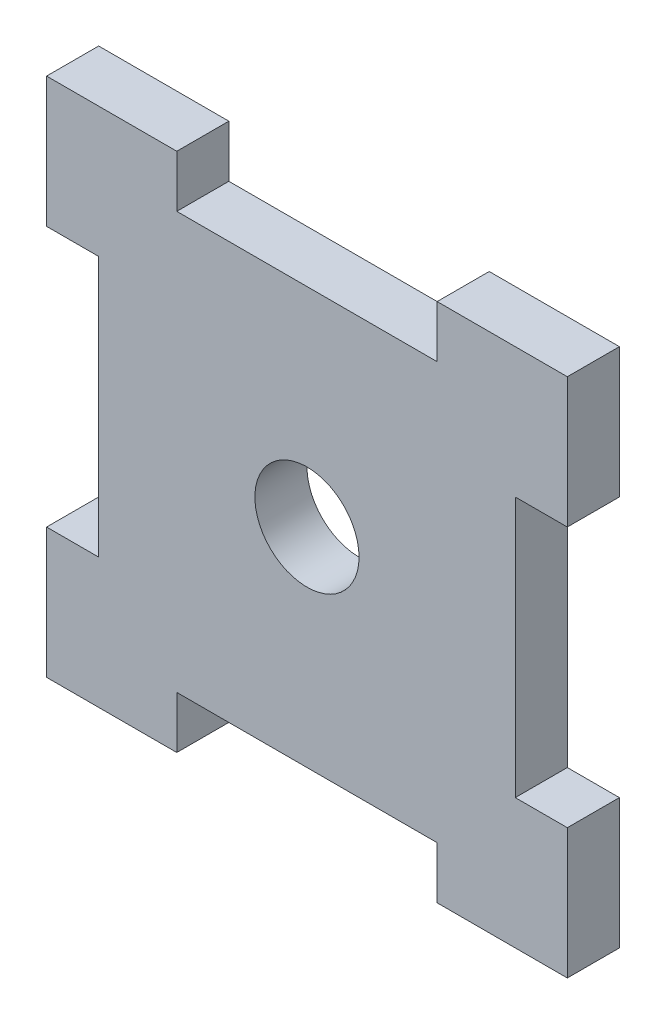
ISO-10303-21;
HEADER;
FILE_DESCRIPTION(('STEP AP214'),'2;1');
FILE_NAME('part.step','',(''),(''),'','','');
FILE_SCHEMA(('AUTOMOTIVE_DESIGN { 1 0 10303 214 1 1 1 1 }'));
ENDSEC;
DATA;
#1=APPLICATION_CONTEXT('core data for automotive mechanical design processes');
#2=APPLICATION_PROTOCOL_DEFINITION('international standard','automotive_design',2000,#1);
#3=PRODUCT_CONTEXT('',#1,'mechanical');
#4=PRODUCT('Part','Part','',(#3));
#5=PRODUCT_RELATED_PRODUCT_CATEGORY('part','',(#4));
#6=PRODUCT_DEFINITION_FORMATION('','',#4);
#7=PRODUCT_DEFINITION_CONTEXT('part definition',#1,'design');
#8=PRODUCT_DEFINITION('design','',#6,#7);
#9=PRODUCT_DEFINITION_SHAPE('','',#8);
#10=(LENGTH_UNIT() NAMED_UNIT(*) SI_UNIT(.MILLI.,.METRE.));
#11=(NAMED_UNIT(*) PLANE_ANGLE_UNIT() SI_UNIT($,.RADIAN.));
#12=(NAMED_UNIT(*) SI_UNIT($,.STERADIAN.) SOLID_ANGLE_UNIT());
#13=UNCERTAINTY_MEASURE_WITH_UNIT(LENGTH_MEASURE(1.E-05),#10,'distance_accuracy_value','');
#14=(GEOMETRIC_REPRESENTATION_CONTEXT(3) GLOBAL_UNCERTAINTY_ASSIGNED_CONTEXT((#13)) GLOBAL_UNIT_ASSIGNED_CONTEXT((#10,
#11,#12)) REPRESENTATION_CONTEXT('',''));
#15=CARTESIAN_POINT('',(0.,0.,0.));
#16=DIRECTION('',(0.,0.,1.));
#17=DIRECTION('',(1.,0.,0.));
#18=AXIS2_PLACEMENT_3D('',#15,#16,#17);
#19=CARTESIAN_POINT('',(0.,0.,3.));
#20=DIRECTION('',(0.,0.,1.));
#21=DIRECTION('',(1.,0.,0.));
#22=AXIS2_PLACEMENT_3D('',#19,#20,#21);
#23=PLANE('',#22);
#24=DIRECTION('',(0.,-1.,0.));
#25=VECTOR('',#24,1.);
#26=CARTESIAN_POINT('',(0.,0.,3.));
#27=LINE('',#26,#25);
#28=CARTESIAN_POINT('',(0.,7.5,3.));
#29=VERTEX_POINT('',#28);
#30=CARTESIAN_POINT('',(0.,0.,3.));
#31=VERTEX_POINT('',#30);
#32=EDGE_CURVE('E272',#29,#31,#27,.T.);
#33=ORIENTED_EDGE('',*,*,#32,.T.);
#34=DIRECTION('',(1.,0.,0.));
#35=VECTOR('',#34,1.);
#36=CARTESIAN_POINT('',(0.,0.,3.));
#37=LINE('',#36,#35);
#38=CARTESIAN_POINT('',(7.5,0.,3.));
#39=VERTEX_POINT('',#38);
#40=EDGE_CURVE('E136',#31,#39,#37,.T.);
#41=ORIENTED_EDGE('',*,*,#40,.T.);
#42=DIRECTION('',(0.,1.,0.));
#43=VECTOR('',#42,1.);
#44=CARTESIAN_POINT('',(7.5,3.,3.));
#45=LINE('',#44,#43);
#46=CARTESIAN_POINT('',(7.5,3.,3.));
#47=VERTEX_POINT('',#46);
#48=EDGE_CURVE('E341',#39,#47,#45,.T.);
#49=ORIENTED_EDGE('',*,*,#48,.T.);
#50=DIRECTION('',(1.,0.,0.));
#51=VECTOR('',#50,1.);
#52=CARTESIAN_POINT('',(7.5,3.,3.));
#53=LINE('',#52,#51);
#54=CARTESIAN_POINT('',(22.5,3.,3.));
#55=VERTEX_POINT('',#54);
#56=EDGE_CURVE('E361',#47,#55,#53,.T.);
#57=ORIENTED_EDGE('',*,*,#56,.T.);
#58=DIRECTION('',(0.,-1.,0.));
#59=VECTOR('',#58,1.);
#60=CARTESIAN_POINT('',(22.5,3.,3.));
#61=LINE('',#60,#59);
#62=CARTESIAN_POINT('',(22.5,0.,3.));
#63=VERTEX_POINT('',#62);
#64=EDGE_CURVE('E357',#55,#63,#61,.T.);
#65=ORIENTED_EDGE('',*,*,#64,.T.);
#66=DIRECTION('',(1.,0.,0.));
#67=VECTOR('',#66,1.);
#68=CARTESIAN_POINT('',(22.5,0.,3.));
#69=LINE('',#68,#67);
#70=CARTESIAN_POINT('',(30.,0.,3.));
#71=VERTEX_POINT('',#70);
#72=EDGE_CURVE('E360',#63,#71,#69,.T.);
#73=ORIENTED_EDGE('',*,*,#72,.T.);
#74=DIRECTION('',(0.,1.,0.));
#75=VECTOR('',#74,1.);
#76=CARTESIAN_POINT('',(30.,0.,3.));
#77=LINE('',#76,#75);
#78=CARTESIAN_POINT('',(30.,7.5,3.));
#79=VERTEX_POINT('',#78);
#80=EDGE_CURVE('E365',#71,#79,#77,.T.);
#81=ORIENTED_EDGE('',*,*,#80,.T.);
#82=DIRECTION('',(-1.,0.,0.));
#83=VECTOR('',#82,1.);
#84=CARTESIAN_POINT('',(27.,7.5,3.));
#85=LINE('',#84,#83);
#86=CARTESIAN_POINT('',(27.,7.5,3.));
#87=VERTEX_POINT('',#86);
#88=EDGE_CURVE('E372',#79,#87,#85,.T.);
#89=ORIENTED_EDGE('',*,*,#88,.T.);
#90=DIRECTION('',(0.,1.,0.));
#91=VECTOR('',#90,1.);
#92=CARTESIAN_POINT('',(27.,22.5,3.));
#93=LINE('',#92,#91);
#94=CARTESIAN_POINT('',(27.,22.5,3.));
#95=VERTEX_POINT('',#94);
#96=EDGE_CURVE('E375',#87,#95,#93,.T.);
#97=ORIENTED_EDGE('',*,*,#96,.T.);
#98=DIRECTION('',(1.,0.,0.));
#99=VECTOR('',#98,1.);
#100=CARTESIAN_POINT('',(27.,22.5,3.));
#101=LINE('',#100,#99);
#102=CARTESIAN_POINT('',(30.,22.5,3.));
#103=VERTEX_POINT('',#102);
#104=EDGE_CURVE('E378',#95,#103,#101,.T.);
#105=ORIENTED_EDGE('',*,*,#104,.T.);
#106=DIRECTION('',(0.,1.,0.));
#107=VECTOR('',#106,1.);
#108=CARTESIAN_POINT('',(30.,22.5,3.));
#109=LINE('',#108,#107);
#110=CARTESIAN_POINT('',(30.,30.,3.));
#111=VERTEX_POINT('',#110);
#112=EDGE_CURVE('E381',#103,#111,#109,.T.);
#113=ORIENTED_EDGE('',*,*,#112,.T.);
#114=DIRECTION('',(-1.,0.,0.));
#115=VECTOR('',#114,1.);
#116=CARTESIAN_POINT('',(22.5,30.,3.));
#117=LINE('',#116,#115);
#118=CARTESIAN_POINT('',(22.5,30.,3.));
#119=VERTEX_POINT('',#118);
#120=EDGE_CURVE('E384',#111,#119,#117,.T.);
#121=ORIENTED_EDGE('',*,*,#120,.T.);
#122=DIRECTION('',(0.,-1.,0.));
#123=VECTOR('',#122,1.);
#124=CARTESIAN_POINT('',(22.5,27.,3.));
#125=LINE('',#124,#123);
#126=CARTESIAN_POINT('',(22.5,27.,3.));
#127=VERTEX_POINT('',#126);
#128=EDGE_CURVE('E387',#119,#127,#125,.T.);
#129=ORIENTED_EDGE('',*,*,#128,.T.);
#130=DIRECTION('',(-1.,0.,0.));
#131=VECTOR('',#130,1.);
#132=CARTESIAN_POINT('',(7.5,27.,3.));
#133=LINE('',#132,#131);
#134=CARTESIAN_POINT('',(7.5,27.,3.));
#135=VERTEX_POINT('',#134);
#136=EDGE_CURVE('E390',#127,#135,#133,.T.);
#137=ORIENTED_EDGE('',*,*,#136,.T.);
#138=DIRECTION('',(0.,1.,0.));
#139=VECTOR('',#138,1.);
#140=CARTESIAN_POINT('',(7.5,27.,3.));
#141=LINE('',#140,#139);
#142=CARTESIAN_POINT('',(7.5,30.,3.));
#143=VERTEX_POINT('',#142);
#144=EDGE_CURVE('E393',#135,#143,#141,.T.);
#145=ORIENTED_EDGE('',*,*,#144,.T.);
#146=DIRECTION('',(-1.,0.,0.));
#147=VECTOR('',#146,1.);
#148=CARTESIAN_POINT('',(0.,30.,3.));
#149=LINE('',#148,#147);
#150=CARTESIAN_POINT('',(0.,30.,3.));
#151=VERTEX_POINT('',#150);
#152=EDGE_CURVE('E396',#143,#151,#149,.T.);
#153=ORIENTED_EDGE('',*,*,#152,.T.);
#154=DIRECTION('',(0.,-1.,0.));
#155=VECTOR('',#154,1.);
#156=CARTESIAN_POINT('',(0.,22.5,3.));
#157=LINE('',#156,#155);
#158=CARTESIAN_POINT('',(0.,22.5,3.));
#159=VERTEX_POINT('',#158);
#160=EDGE_CURVE('E191',#151,#159,#157,.T.);
#161=ORIENTED_EDGE('',*,*,#160,.T.);
#162=DIRECTION('',(1.,0.,0.));
#163=VECTOR('',#162,1.);
#164=CARTESIAN_POINT('',(2.99999999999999,22.5,3.));
#165=LINE('',#164,#163);
#166=CARTESIAN_POINT('',(2.99999999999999,22.5,3.));
#167=VERTEX_POINT('',#166);
#168=EDGE_CURVE('E185',#159,#167,#165,.T.);
#169=ORIENTED_EDGE('',*,*,#168,.T.);
#170=DIRECTION('',(0.,-1.,0.));
#171=VECTOR('',#170,1.);
#172=CARTESIAN_POINT('',(2.99999999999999,22.5,3.));
#173=LINE('',#172,#171);
#174=CARTESIAN_POINT('',(2.99999999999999,7.5,3.));
#175=VERTEX_POINT('',#174);
#176=EDGE_CURVE('E189',#167,#175,#173,.T.);
#177=ORIENTED_EDGE('',*,*,#176,.T.);
#178=DIRECTION('',(-1.,0.,0.));
#179=VECTOR('',#178,1.);
#180=CARTESIAN_POINT('',(2.99999999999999,7.5,3.));
#181=LINE('',#180,#179);
#182=EDGE_CURVE('E57',#175,#29,#181,.T.);
#183=ORIENTED_EDGE('',*,*,#182,.T.);
#184=EDGE_LOOP('',(#33,#41,#49,#57,#65,#73,#81,#89,#97,#105,#113,#121,#129,#137,#145,#153,#161,
#169,#177,#183));
#185=FACE_BOUND('',#184,.T.);
#186=CARTESIAN_POINT('',(15.,15.,3.));
#187=DIRECTION('',(0.,0.,1.));
#188=DIRECTION('',(1.,0.,0.));
#189=AXIS2_PLACEMENT_3D('',#186,#187,#188);
#190=CIRCLE('',#189,3.);
#191=CARTESIAN_POINT('',(18.,15.,3.));
#192=VERTEX_POINT('',#191);
#193=EDGE_CURVE('E218',#192,#192,#190,.T.);
#194=ORIENTED_EDGE('',*,*,#193,.F.);
#195=EDGE_LOOP('',(#194));
#196=FACE_BOUND('',#195,.T.);
#197=ADVANCED_FACE('F39',(#185,#196),#23,.T.);
#198=CARTESIAN_POINT('',(0.,0.,0.));
#199=DIRECTION('',(0.,0.,1.));
#200=DIRECTION('',(1.,0.,0.));
#201=AXIS2_PLACEMENT_3D('',#198,#199,#200);
#202=PLANE('',#201);
#203=DIRECTION('',(0.,-1.,0.));
#204=VECTOR('',#203,1.);
#205=CARTESIAN_POINT('',(0.,0.,0.));
#206=LINE('',#205,#204);
#207=CARTESIAN_POINT('',(0.,7.5,0.));
#208=VERTEX_POINT('',#207);
#209=CARTESIAN_POINT('',(0.,0.,0.));
#210=VERTEX_POINT('',#209);
#211=EDGE_CURVE('E213',#208,#210,#206,.T.);
#212=ORIENTED_EDGE('',*,*,#211,.F.);
#213=DIRECTION('',(-1.,0.,0.));
#214=VECTOR('',#213,1.);
#215=CARTESIAN_POINT('',(2.99999999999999,7.5,0.));
#216=LINE('',#215,#214);
#217=CARTESIAN_POINT('',(2.99999999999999,7.5,0.));
#218=VERTEX_POINT('',#217);
#219=EDGE_CURVE('E128',#218,#208,#216,.T.);
#220=ORIENTED_EDGE('',*,*,#219,.F.);
#221=DIRECTION('',(0.,-1.,0.));
#222=VECTOR('',#221,1.);
#223=CARTESIAN_POINT('',(2.99999999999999,22.5,0.));
#224=LINE('',#223,#222);
#225=CARTESIAN_POINT('',(2.99999999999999,22.5,0.));
#226=VERTEX_POINT('',#225);
#227=EDGE_CURVE('E122',#226,#218,#224,.T.);
#228=ORIENTED_EDGE('',*,*,#227,.F.);
#229=DIRECTION('',(1.,0.,0.));
#230=VECTOR('',#229,1.);
#231=CARTESIAN_POINT('',(2.99999999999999,22.5,0.));
#232=LINE('',#231,#230);
#233=CARTESIAN_POINT('',(0.,22.5,0.));
#234=VERTEX_POINT('',#233);
#235=EDGE_CURVE('E200',#234,#226,#232,.T.);
#236=ORIENTED_EDGE('',*,*,#235,.F.);
#237=DIRECTION('',(0.,-1.,0.));
#238=VECTOR('',#237,1.);
#239=CARTESIAN_POINT('',(0.,22.5,0.));
#240=LINE('',#239,#238);
#241=CARTESIAN_POINT('',(0.,30.,0.));
#242=VERTEX_POINT('',#241);
#243=EDGE_CURVE('E263',#242,#234,#240,.T.);
#244=ORIENTED_EDGE('',*,*,#243,.F.);
#245=DIRECTION('',(-1.,0.,0.));
#246=VECTOR('',#245,1.);
#247=CARTESIAN_POINT('',(0.,30.,0.));
#248=LINE('',#247,#246);
#249=CARTESIAN_POINT('',(7.5,30.,0.));
#250=VERTEX_POINT('',#249);
#251=EDGE_CURVE('E260',#250,#242,#248,.T.);
#252=ORIENTED_EDGE('',*,*,#251,.F.);
#253=DIRECTION('',(0.,1.,0.));
#254=VECTOR('',#253,1.);
#255=CARTESIAN_POINT('',(7.5,27.,0.));
#256=LINE('',#255,#254);
#257=CARTESIAN_POINT('',(7.5,27.,0.));
#258=VERTEX_POINT('',#257);
#259=EDGE_CURVE('E257',#258,#250,#256,.T.);
#260=ORIENTED_EDGE('',*,*,#259,.F.);
#261=DIRECTION('',(-1.,0.,0.));
#262=VECTOR('',#261,1.);
#263=CARTESIAN_POINT('',(7.5,27.,0.));
#264=LINE('',#263,#262);
#265=CARTESIAN_POINT('',(22.5,27.,0.));
#266=VERTEX_POINT('',#265);
#267=EDGE_CURVE('E254',#266,#258,#264,.T.);
#268=ORIENTED_EDGE('',*,*,#267,.F.);
#269=DIRECTION('',(0.,-1.,0.));
#270=VECTOR('',#269,1.);
#271=CARTESIAN_POINT('',(22.5,27.,0.));
#272=LINE('',#271,#270);
#273=CARTESIAN_POINT('',(22.5,30.,0.));
#274=VERTEX_POINT('',#273);
#275=EDGE_CURVE('E251',#274,#266,#272,.T.);
#276=ORIENTED_EDGE('',*,*,#275,.F.);
#277=DIRECTION('',(-1.,0.,0.));
#278=VECTOR('',#277,1.);
#279=CARTESIAN_POINT('',(22.5,30.,0.));
#280=LINE('',#279,#278);
#281=CARTESIAN_POINT('',(30.,30.,0.));
#282=VERTEX_POINT('',#281);
#283=EDGE_CURVE('E248',#282,#274,#280,.T.);
#284=ORIENTED_EDGE('',*,*,#283,.F.);
#285=DIRECTION('',(0.,1.,0.));
#286=VECTOR('',#285,1.);
#287=CARTESIAN_POINT('',(30.,22.5,0.));
#288=LINE('',#287,#286);
#289=CARTESIAN_POINT('',(30.,22.5,0.));
#290=VERTEX_POINT('',#289);
#291=EDGE_CURVE('E245',#290,#282,#288,.T.);
#292=ORIENTED_EDGE('',*,*,#291,.F.);
#293=DIRECTION('',(1.,0.,0.));
#294=VECTOR('',#293,1.);
#295=CARTESIAN_POINT('',(27.,22.5,0.));
#296=LINE('',#295,#294);
#297=CARTESIAN_POINT('',(27.,22.5,0.));
#298=VERTEX_POINT('',#297);
#299=EDGE_CURVE('E242',#298,#290,#296,.T.);
#300=ORIENTED_EDGE('',*,*,#299,.F.);
#301=DIRECTION('',(0.,1.,0.));
#302=VECTOR('',#301,1.);
#303=CARTESIAN_POINT('',(27.,22.5,0.));
#304=LINE('',#303,#302);
#305=CARTESIAN_POINT('',(27.,7.5,0.));
#306=VERTEX_POINT('',#305);
#307=EDGE_CURVE('E239',#306,#298,#304,.T.);
#308=ORIENTED_EDGE('',*,*,#307,.F.);
#309=DIRECTION('',(-1.,0.,0.));
#310=VECTOR('',#309,1.);
#311=CARTESIAN_POINT('',(27.,7.5,0.));
#312=LINE('',#311,#310);
#313=CARTESIAN_POINT('',(30.,7.5,0.));
#314=VERTEX_POINT('',#313);
#315=EDGE_CURVE('E236',#314,#306,#312,.T.);
#316=ORIENTED_EDGE('',*,*,#315,.F.);
#317=DIRECTION('',(0.,1.,0.));
#318=VECTOR('',#317,1.);
#319=CARTESIAN_POINT('',(30.,0.,0.));
#320=LINE('',#319,#318);
#321=CARTESIAN_POINT('',(30.,0.,0.));
#322=VERTEX_POINT('',#321);
#323=EDGE_CURVE('E233',#322,#314,#320,.T.);
#324=ORIENTED_EDGE('',*,*,#323,.F.);
#325=DIRECTION('',(1.,0.,0.));
#326=VECTOR('',#325,1.);
#327=CARTESIAN_POINT('',(22.5,0.,0.));
#328=LINE('',#327,#326);
#329=CARTESIAN_POINT('',(22.5,0.,0.));
#330=VERTEX_POINT('',#329);
#331=EDGE_CURVE('E230',#330,#322,#328,.T.);
#332=ORIENTED_EDGE('',*,*,#331,.F.);
#333=DIRECTION('',(0.,-1.,0.));
#334=VECTOR('',#333,1.);
#335=CARTESIAN_POINT('',(22.5,3.,0.));
#336=LINE('',#335,#334);
#337=CARTESIAN_POINT('',(22.5,3.,0.));
#338=VERTEX_POINT('',#337);
#339=EDGE_CURVE('E227',#338,#330,#336,.T.);
#340=ORIENTED_EDGE('',*,*,#339,.F.);
#341=DIRECTION('',(1.,0.,0.));
#342=VECTOR('',#341,1.);
#343=CARTESIAN_POINT('',(7.5,3.,0.));
#344=LINE('',#343,#342);
#345=CARTESIAN_POINT('',(7.5,3.,0.));
#346=VERTEX_POINT('',#345);
#347=EDGE_CURVE('E224',#346,#338,#344,.T.);
#348=ORIENTED_EDGE('',*,*,#347,.F.);
#349=DIRECTION('',(0.,1.,0.));
#350=VECTOR('',#349,1.);
#351=CARTESIAN_POINT('',(7.5,3.,0.));
#352=LINE('',#351,#350);
#353=CARTESIAN_POINT('',(7.5,0.,0.));
#354=VERTEX_POINT('',#353);
#355=EDGE_CURVE('E221',#354,#346,#352,.T.);
#356=ORIENTED_EDGE('',*,*,#355,.F.);
#357=DIRECTION('',(1.,0.,0.));
#358=VECTOR('',#357,1.);
#359=CARTESIAN_POINT('',(0.,0.,0.));
#360=LINE('',#359,#358);
#361=EDGE_CURVE('E217',#210,#354,#360,.T.);
#362=ORIENTED_EDGE('',*,*,#361,.F.);
#363=EDGE_LOOP('',(#212,#220,#228,#236,#244,#252,#260,#268,#276,#284,#292,#300,#308,#316,#324,
#332,#340,#348,#356,#362));
#364=FACE_BOUND('',#363,.T.);
#365=CARTESIAN_POINT('',(15.,15.,0.));
#366=DIRECTION('',(0.,0.,1.));
#367=DIRECTION('',(1.,0.,0.));
#368=AXIS2_PLACEMENT_3D('',#365,#366,#367);
#369=CIRCLE('',#368,3.);
#370=CARTESIAN_POINT('',(18.,15.,0.));
#371=VERTEX_POINT('',#370);
#372=EDGE_CURVE('E649',#371,#371,#369,.T.);
#373=ORIENTED_EDGE('',*,*,#372,.T.);
#374=EDGE_LOOP('',(#373));
#375=FACE_BOUND('',#374,.T.);
#376=ADVANCED_FACE('F345',(#364,#375),#202,.F.);
#377=CARTESIAN_POINT('',(0.,0.,3.));
#378=DIRECTION('',(1.,0.,0.));
#379=DIRECTION('',(0.,0.,-1.));
#380=AXIS2_PLACEMENT_3D('',#377,#378,#379);
#381=PLANE('',#380);
#382=ORIENTED_EDGE('',*,*,#211,.T.);
#383=DIRECTION('',(0.,0.,-1.));
#384=VECTOR('',#383,1.);
#385=CARTESIAN_POINT('',(0.,0.,3.));
#386=LINE('',#385,#384);
#387=EDGE_CURVE('E11',#31,#210,#386,.T.);
#388=ORIENTED_EDGE('',*,*,#387,.F.);
#389=ORIENTED_EDGE('',*,*,#32,.F.);
#390=DIRECTION('',(0.,0.,-1.));
#391=VECTOR('',#390,1.);
#392=CARTESIAN_POINT('',(0.,7.5,3.));
#393=LINE('',#392,#391);
#394=EDGE_CURVE('E209',#29,#208,#393,.T.);
#395=ORIENTED_EDGE('',*,*,#394,.T.);
#396=EDGE_LOOP('',(#382,#388,#389,#395));
#397=FACE_BOUND('',#396,.T.);
#398=ADVANCED_FACE('F41',(#397),#381,.F.);
#399=CARTESIAN_POINT('',(0.,0.,3.));
#400=DIRECTION('',(0.,1.,0.));
#401=DIRECTION('',(0.,0.,1.));
#402=AXIS2_PLACEMENT_3D('',#399,#400,#401);
#403=PLANE('',#402);
#404=ORIENTED_EDGE('',*,*,#361,.T.);
#405=DIRECTION('',(0.,0.,-1.));
#406=VECTOR('',#405,1.);
#407=CARTESIAN_POINT('',(7.5,0.,3.));
#408=LINE('',#407,#406);
#409=EDGE_CURVE('E49',#39,#354,#408,.T.);
#410=ORIENTED_EDGE('',*,*,#409,.F.);
#411=ORIENTED_EDGE('',*,*,#40,.F.);
#412=ORIENTED_EDGE('',*,*,#387,.T.);
#413=EDGE_LOOP('',(#404,#410,#411,#412));
#414=FACE_BOUND('',#413,.T.);
#415=ADVANCED_FACE('F432',(#414),#403,.F.);
#416=CARTESIAN_POINT('',(7.5,3.,3.));
#417=DIRECTION('',(-1.,0.,0.));
#418=DIRECTION('',(0.,0.,1.));
#419=AXIS2_PLACEMENT_3D('',#416,#417,#418);
#420=PLANE('',#419);
#421=ORIENTED_EDGE('',*,*,#355,.T.);
#422=DIRECTION('',(0.,0.,-1.));
#423=VECTOR('',#422,1.);
#424=CARTESIAN_POINT('',(7.5,3.,3.));
#425=LINE('',#424,#423);
#426=EDGE_CURVE('E331',#47,#346,#425,.T.);
#427=ORIENTED_EDGE('',*,*,#426,.F.);
#428=ORIENTED_EDGE('',*,*,#48,.F.);
#429=ORIENTED_EDGE('',*,*,#409,.T.);
#430=EDGE_LOOP('',(#421,#427,#428,#429));
#431=FACE_BOUND('',#430,.T.);
#432=ADVANCED_FACE('F339',(#431),#420,.F.);
#433=CARTESIAN_POINT('',(7.5,3.,3.));
#434=DIRECTION('',(0.,1.,0.));
#435=DIRECTION('',(-1.,0.,0.));
#436=AXIS2_PLACEMENT_3D('',#433,#434,#435);
#437=PLANE('',#436);
#438=ORIENTED_EDGE('',*,*,#347,.T.);
#439=DIRECTION('',(0.,0.,-1.));
#440=VECTOR('',#439,1.);
#441=CARTESIAN_POINT('',(22.5,3.,3.));
#442=LINE('',#441,#440);
#443=EDGE_CURVE('E327',#55,#338,#442,.T.);
#444=ORIENTED_EDGE('',*,*,#443,.F.);
#445=ORIENTED_EDGE('',*,*,#56,.F.);
#446=ORIENTED_EDGE('',*,*,#426,.T.);
#447=EDGE_LOOP('',(#438,#444,#445,#446));
#448=FACE_BOUND('',#447,.T.);
#449=ADVANCED_FACE('F351',(#448),#437,.F.);
#450=CARTESIAN_POINT('',(22.5,3.,3.));
#451=DIRECTION('',(1.,0.,0.));
#452=DIRECTION('',(0.,0.,-1.));
#453=AXIS2_PLACEMENT_3D('',#450,#451,#452);
#454=PLANE('',#453);
#455=ORIENTED_EDGE('',*,*,#339,.T.);
#456=DIRECTION('',(0.,0.,-1.));
#457=VECTOR('',#456,1.);
#458=CARTESIAN_POINT('',(22.5,0.,3.));
#459=LINE('',#458,#457);
#460=EDGE_CURVE('E323',#63,#330,#459,.T.);
#461=ORIENTED_EDGE('',*,*,#460,.F.);
#462=ORIENTED_EDGE('',*,*,#64,.F.);
#463=ORIENTED_EDGE('',*,*,#443,.T.);
#464=EDGE_LOOP('',(#455,#461,#462,#463));
#465=FACE_BOUND('',#464,.T.);
#466=ADVANCED_FACE('F355',(#465),#454,.F.);
#467=CARTESIAN_POINT('',(22.5,0.,3.));
#468=DIRECTION('',(0.,1.,0.));
#469=DIRECTION('',(0.,0.,1.));
#470=AXIS2_PLACEMENT_3D('',#467,#468,#469);
#471=PLANE('',#470);
#472=ORIENTED_EDGE('',*,*,#331,.T.);
#473=DIRECTION('',(0.,0.,-1.));
#474=VECTOR('',#473,1.);
#475=CARTESIAN_POINT('',(30.,0.,3.));
#476=LINE('',#475,#474);
#477=EDGE_CURVE('E319',#71,#322,#476,.T.);
#478=ORIENTED_EDGE('',*,*,#477,.F.);
#479=ORIENTED_EDGE('',*,*,#72,.F.);
#480=ORIENTED_EDGE('',*,*,#460,.T.);
#481=EDGE_LOOP('',(#472,#478,#479,#480));
#482=FACE_BOUND('',#481,.T.);
#483=ADVANCED_FACE('F445',(#482),#471,.F.);
#484=CARTESIAN_POINT('',(30.,0.,3.));
#485=DIRECTION('',(-1.,0.,0.));
#486=DIRECTION('',(0.,0.,1.));
#487=AXIS2_PLACEMENT_3D('',#484,#485,#486);
#488=PLANE('',#487);
#489=ORIENTED_EDGE('',*,*,#323,.T.);
#490=DIRECTION('',(0.,0.,-1.));
#491=VECTOR('',#490,1.);
#492=CARTESIAN_POINT('',(30.,7.5,3.));
#493=LINE('',#492,#491);
#494=EDGE_CURVE('E315',#79,#314,#493,.T.);
#495=ORIENTED_EDGE('',*,*,#494,.F.);
#496=ORIENTED_EDGE('',*,*,#80,.F.);
#497=ORIENTED_EDGE('',*,*,#477,.T.);
#498=EDGE_LOOP('',(#489,#495,#496,#497));
#499=FACE_BOUND('',#498,.T.);
#500=ADVANCED_FACE('F448',(#499),#488,.F.);
#501=CARTESIAN_POINT('',(27.,7.5,3.));
#502=DIRECTION('',(0.,-1.,0.));
#503=DIRECTION('',(0.,0.,-1.));
#504=AXIS2_PLACEMENT_3D('',#501,#502,#503);
#505=PLANE('',#504);
#506=ORIENTED_EDGE('',*,*,#315,.T.);
#507=DIRECTION('',(0.,0.,-1.));
#508=VECTOR('',#507,1.);
#509=CARTESIAN_POINT('',(27.,7.5,3.));
#510=LINE('',#509,#508);
#511=EDGE_CURVE('E311',#87,#306,#510,.T.);
#512=ORIENTED_EDGE('',*,*,#511,.F.);
#513=ORIENTED_EDGE('',*,*,#88,.F.);
#514=ORIENTED_EDGE('',*,*,#494,.T.);
#515=EDGE_LOOP('',(#506,#512,#513,#514));
#516=FACE_BOUND('',#515,.T.);
#517=ADVANCED_FACE('F452',(#516),#505,.F.);
#518=CARTESIAN_POINT('',(27.,22.5,3.));
#519=DIRECTION('',(-1.,0.,0.));
#520=DIRECTION('',(0.,-1.,0.));
#521=AXIS2_PLACEMENT_3D('',#518,#519,#520);
#522=PLANE('',#521);
#523=ORIENTED_EDGE('',*,*,#307,.T.);
#524=DIRECTION('',(0.,0.,-1.));
#525=VECTOR('',#524,1.);
#526=CARTESIAN_POINT('',(27.,22.5,3.));
#527=LINE('',#526,#525);
#528=EDGE_CURVE('E307',#95,#298,#527,.T.);
#529=ORIENTED_EDGE('',*,*,#528,.F.);
#530=ORIENTED_EDGE('',*,*,#96,.F.);
#531=ORIENTED_EDGE('',*,*,#511,.T.);
#532=EDGE_LOOP('',(#523,#529,#530,#531));
#533=FACE_BOUND('',#532,.T.);
#534=ADVANCED_FACE('F456',(#533),#522,.F.);
#535=CARTESIAN_POINT('',(27.,22.5,3.));
#536=DIRECTION('',(0.,1.,0.));
#537=DIRECTION('',(0.,0.,1.));
#538=AXIS2_PLACEMENT_3D('',#535,#536,#537);
#539=PLANE('',#538);
#540=ORIENTED_EDGE('',*,*,#299,.T.);
#541=DIRECTION('',(0.,0.,-1.));
#542=VECTOR('',#541,1.);
#543=CARTESIAN_POINT('',(30.,22.5,3.));
#544=LINE('',#543,#542);
#545=EDGE_CURVE('E303',#103,#290,#544,.T.);
#546=ORIENTED_EDGE('',*,*,#545,.F.);
#547=ORIENTED_EDGE('',*,*,#104,.F.);
#548=ORIENTED_EDGE('',*,*,#528,.T.);
#549=EDGE_LOOP('',(#540,#546,#547,#548));
#550=FACE_BOUND('',#549,.T.);
#551=ADVANCED_FACE('F460',(#550),#539,.F.);
#552=CARTESIAN_POINT('',(30.,22.5,3.));
#553=DIRECTION('',(-1.,0.,0.));
#554=DIRECTION('',(0.,0.,1.));
#555=AXIS2_PLACEMENT_3D('',#552,#553,#554);
#556=PLANE('',#555);
#557=ORIENTED_EDGE('',*,*,#291,.T.);
#558=DIRECTION('',(0.,0.,-1.));
#559=VECTOR('',#558,1.);
#560=CARTESIAN_POINT('',(30.,30.,3.));
#561=LINE('',#560,#559);
#562=EDGE_CURVE('E299',#111,#282,#561,.T.);
#563=ORIENTED_EDGE('',*,*,#562,.F.);
#564=ORIENTED_EDGE('',*,*,#112,.F.);
#565=ORIENTED_EDGE('',*,*,#545,.T.);
#566=EDGE_LOOP('',(#557,#563,#564,#565));
#567=FACE_BOUND('',#566,.T.);
#568=ADVANCED_FACE('F464',(#567),#556,.F.);
#569=CARTESIAN_POINT('',(22.5,30.,3.));
#570=DIRECTION('',(0.,-1.,0.));
#571=DIRECTION('',(0.,0.,-1.));
#572=AXIS2_PLACEMENT_3D('',#569,#570,#571);
#573=PLANE('',#572);
#574=ORIENTED_EDGE('',*,*,#283,.T.);
#575=DIRECTION('',(0.,0.,-1.));
#576=VECTOR('',#575,1.);
#577=CARTESIAN_POINT('',(22.5,30.,3.));
#578=LINE('',#577,#576);
#579=EDGE_CURVE('E295',#119,#274,#578,.T.);
#580=ORIENTED_EDGE('',*,*,#579,.F.);
#581=ORIENTED_EDGE('',*,*,#120,.F.);
#582=ORIENTED_EDGE('',*,*,#562,.T.);
#583=EDGE_LOOP('',(#574,#580,#581,#582));
#584=FACE_BOUND('',#583,.T.);
#585=ADVANCED_FACE('F468',(#584),#573,.F.);
#586=CARTESIAN_POINT('',(22.5,27.,3.));
#587=DIRECTION('',(1.,0.,0.));
#588=DIRECTION('',(0.,0.,-1.));
#589=AXIS2_PLACEMENT_3D('',#586,#587,#588);
#590=PLANE('',#589);
#591=ORIENTED_EDGE('',*,*,#275,.T.);
#592=DIRECTION('',(0.,0.,-1.));
#593=VECTOR('',#592,1.);
#594=CARTESIAN_POINT('',(22.5,27.,3.));
#595=LINE('',#594,#593);
#596=EDGE_CURVE('E291',#127,#266,#595,.T.);
#597=ORIENTED_EDGE('',*,*,#596,.F.);
#598=ORIENTED_EDGE('',*,*,#128,.F.);
#599=ORIENTED_EDGE('',*,*,#579,.T.);
#600=EDGE_LOOP('',(#591,#597,#598,#599));
#601=FACE_BOUND('',#600,.T.);
#602=ADVANCED_FACE('F472',(#601),#590,.F.);
#603=CARTESIAN_POINT('',(7.5,27.,3.));
#604=DIRECTION('',(0.,-1.,0.));
#605=DIRECTION('',(1.,0.,0.));
#606=AXIS2_PLACEMENT_3D('',#603,#604,#605);
#607=PLANE('',#606);
#608=ORIENTED_EDGE('',*,*,#267,.T.);
#609=DIRECTION('',(0.,0.,-1.));
#610=VECTOR('',#609,1.);
#611=CARTESIAN_POINT('',(7.5,27.,3.));
#612=LINE('',#611,#610);
#613=EDGE_CURVE('E287',#135,#258,#612,.T.);
#614=ORIENTED_EDGE('',*,*,#613,.F.);
#615=ORIENTED_EDGE('',*,*,#136,.F.);
#616=ORIENTED_EDGE('',*,*,#596,.T.);
#617=EDGE_LOOP('',(#608,#614,#615,#616));
#618=FACE_BOUND('',#617,.T.);
#619=ADVANCED_FACE('F476',(#618),#607,.F.);
#620=CARTESIAN_POINT('',(7.5,27.,3.));
#621=DIRECTION('',(-1.,0.,0.));
#622=DIRECTION('',(0.,0.,1.));
#623=AXIS2_PLACEMENT_3D('',#620,#621,#622);
#624=PLANE('',#623);
#625=ORIENTED_EDGE('',*,*,#259,.T.);
#626=DIRECTION('',(0.,0.,-1.));
#627=VECTOR('',#626,1.);
#628=CARTESIAN_POINT('',(7.5,30.,3.));
#629=LINE('',#628,#627);
#630=EDGE_CURVE('E283',#143,#250,#629,.T.);
#631=ORIENTED_EDGE('',*,*,#630,.F.);
#632=ORIENTED_EDGE('',*,*,#144,.F.);
#633=ORIENTED_EDGE('',*,*,#613,.T.);
#634=EDGE_LOOP('',(#625,#631,#632,#633));
#635=FACE_BOUND('',#634,.T.);
#636=ADVANCED_FACE('F480',(#635),#624,.F.);
#637=CARTESIAN_POINT('',(0.,30.,3.));
#638=DIRECTION('',(0.,-1.,0.));
#639=DIRECTION('',(0.,0.,-1.));
#640=AXIS2_PLACEMENT_3D('',#637,#638,#639);
#641=PLANE('',#640);
#642=ORIENTED_EDGE('',*,*,#251,.T.);
#643=DIRECTION('',(0.,0.,-1.));
#644=VECTOR('',#643,1.);
#645=CARTESIAN_POINT('',(0.,30.,3.));
#646=LINE('',#645,#644);
#647=EDGE_CURVE('E279',#151,#242,#646,.T.);
#648=ORIENTED_EDGE('',*,*,#647,.F.);
#649=ORIENTED_EDGE('',*,*,#152,.F.);
#650=ORIENTED_EDGE('',*,*,#630,.T.);
#651=EDGE_LOOP('',(#642,#648,#649,#650));
#652=FACE_BOUND('',#651,.T.);
#653=ADVANCED_FACE('F404',(#652),#641,.F.);
#654=CARTESIAN_POINT('',(0.,22.5,3.));
#655=DIRECTION('',(1.,0.,0.));
#656=DIRECTION('',(0.,0.,-1.));
#657=AXIS2_PLACEMENT_3D('',#654,#655,#656);
#658=PLANE('',#657);
#659=ORIENTED_EDGE('',*,*,#243,.T.);
#660=DIRECTION('',(0.,0.,-1.));
#661=VECTOR('',#660,1.);
#662=CARTESIAN_POINT('',(0.,22.5,3.));
#663=LINE('',#662,#661);
#664=EDGE_CURVE('E202',#159,#234,#663,.T.);
#665=ORIENTED_EDGE('',*,*,#664,.F.);
#666=ORIENTED_EDGE('',*,*,#160,.F.);
#667=ORIENTED_EDGE('',*,*,#647,.T.);
#668=EDGE_LOOP('',(#659,#665,#666,#667));
#669=FACE_BOUND('',#668,.T.);
#670=ADVANCED_FACE('F408',(#669),#658,.F.);
#671=CARTESIAN_POINT('',(2.99999999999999,22.5,3.));
#672=DIRECTION('',(0.,1.,0.));
#673=DIRECTION('',(0.,0.,1.));
#674=AXIS2_PLACEMENT_3D('',#671,#672,#673);
#675=PLANE('',#674);
#676=ORIENTED_EDGE('',*,*,#235,.T.);
#677=DIRECTION('',(0.,0.,-1.));
#678=VECTOR('',#677,1.);
#679=CARTESIAN_POINT('',(2.99999999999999,22.5,3.));
#680=LINE('',#679,#678);
#681=EDGE_CURVE('E197',#167,#226,#680,.T.);
#682=ORIENTED_EDGE('',*,*,#681,.F.);
#683=ORIENTED_EDGE('',*,*,#168,.F.);
#684=ORIENTED_EDGE('',*,*,#664,.T.);
#685=EDGE_LOOP('',(#676,#682,#683,#684));
#686=FACE_BOUND('',#685,.T.);
#687=ADVANCED_FACE('F198',(#686),#675,.F.);
#688=CARTESIAN_POINT('',(2.99999999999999,22.5,3.));
#689=DIRECTION('',(1.,0.,0.));
#690=DIRECTION('',(0.,1.,0.));
#691=AXIS2_PLACEMENT_3D('',#688,#689,#690);
#692=PLANE('',#691);
#693=ORIENTED_EDGE('',*,*,#227,.T.);
#694=DIRECTION('',(0.,0.,-1.));
#695=VECTOR('',#694,1.);
#696=CARTESIAN_POINT('',(2.99999999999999,7.5,3.));
#697=LINE('',#696,#695);
#698=EDGE_CURVE('E203',#175,#218,#697,.T.);
#699=ORIENTED_EDGE('',*,*,#698,.F.);
#700=ORIENTED_EDGE('',*,*,#176,.F.);
#701=ORIENTED_EDGE('',*,*,#681,.T.);
#702=EDGE_LOOP('',(#693,#699,#700,#701));
#703=FACE_BOUND('',#702,.T.);
#704=ADVANCED_FACE('F205',(#703),#692,.F.);
#705=CARTESIAN_POINT('',(2.99999999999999,7.5,3.));
#706=DIRECTION('',(0.,-1.,0.));
#707=DIRECTION('',(0.,0.,-1.));
#708=AXIS2_PLACEMENT_3D('',#705,#706,#707);
#709=PLANE('',#708);
#710=ORIENTED_EDGE('',*,*,#219,.T.);
#711=ORIENTED_EDGE('',*,*,#394,.F.);
#712=ORIENTED_EDGE('',*,*,#182,.F.);
#713=ORIENTED_EDGE('',*,*,#698,.T.);
#714=EDGE_LOOP('',(#710,#711,#712,#713));
#715=FACE_BOUND('',#714,.T.);
#716=ADVANCED_FACE('F412',(#715),#709,.F.);
#717=CARTESIAN_POINT('',(15.,15.,3.));
#718=DIRECTION('',(0.,0.,-1.));
#719=DIRECTION('',(-1.,0.,0.));
#720=AXIS2_PLACEMENT_3D('',#717,#718,#719);
#721=CYLINDRICAL_SURFACE('',#720,3.);
#722=ORIENTED_EDGE('',*,*,#193,.T.);
#723=EDGE_LOOP('',(#722));
#724=FACE_BOUND('',#723,.T.);
#725=ORIENTED_EDGE('',*,*,#372,.F.);
#726=EDGE_LOOP('',(#725));
#727=FACE_BOUND('',#726,.T.);
#728=ADVANCED_FACE('F414',(#724,#727),#721,.F.);
#729=CLOSED_SHELL('',(#197,#376,#398,#415,#432,#449,#466,#483,#500,#517,#534,#551,#568,#585,
#602,#619,#636,#653,#670,#687,#704,#716,#728));
#730=MANIFOLD_SOLID_BREP('B2',#729);
#731=ADVANCED_BREP_SHAPE_REPRESENTATION('',(#18,#730),#14);
#732=SHAPE_DEFINITION_REPRESENTATION(#9,#731);
ENDSEC;
END-ISO-10303-21;
